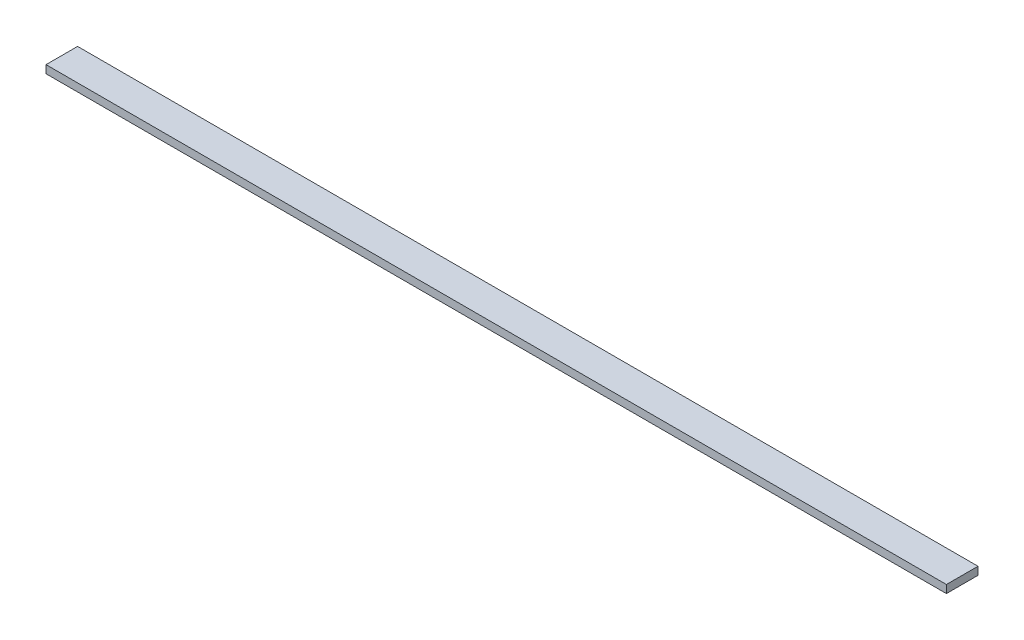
ISO-10303-21;
HEADER;
FILE_DESCRIPTION(('STEP AP214'),'2;1');
FILE_NAME('part.step','',(''),(''),'','','');
FILE_SCHEMA(('AUTOMOTIVE_DESIGN { 1 0 10303 214 1 1 1 1 }'));
ENDSEC;
DATA;
#1=APPLICATION_CONTEXT('core data for automotive mechanical design processes');
#2=APPLICATION_PROTOCOL_DEFINITION('international standard','automotive_design',2000,#1);
#3=PRODUCT_CONTEXT('',#1,'mechanical');
#4=PRODUCT('Part','Part','',(#3));
#5=PRODUCT_RELATED_PRODUCT_CATEGORY('part','',(#4));
#6=PRODUCT_DEFINITION_FORMATION('','',#4);
#7=PRODUCT_DEFINITION_CONTEXT('part definition',#1,'design');
#8=PRODUCT_DEFINITION('design','',#6,#7);
#9=PRODUCT_DEFINITION_SHAPE('','',#8);
#10=(LENGTH_UNIT() NAMED_UNIT(*) SI_UNIT(.MILLI.,.METRE.));
#11=(NAMED_UNIT(*) PLANE_ANGLE_UNIT() SI_UNIT($,.RADIAN.));
#12=(NAMED_UNIT(*) SI_UNIT($,.STERADIAN.) SOLID_ANGLE_UNIT());
#13=UNCERTAINTY_MEASURE_WITH_UNIT(LENGTH_MEASURE(1.E-05),#10,'distance_accuracy_value','');
#14=(GEOMETRIC_REPRESENTATION_CONTEXT(3) GLOBAL_UNCERTAINTY_ASSIGNED_CONTEXT((#13)) GLOBAL_UNIT_ASSIGNED_CONTEXT((#10,
#11,#12)) REPRESENTATION_CONTEXT('',''));
#15=CARTESIAN_POINT('',(0.,0.,0.));
#16=DIRECTION('',(0.,0.,1.));
#17=DIRECTION('',(1.,0.,0.));
#18=AXIS2_PLACEMENT_3D('',#15,#16,#17);
#19=CARTESIAN_POINT('',(361.949999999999,6.35,12.7));
#20=DIRECTION('',(-1.,0.,0.));
#21=DIRECTION('',(0.,0.,1.));
#22=AXIS2_PLACEMENT_3D('',#19,#20,#21);
#23=PLANE('',#22);
#24=DIRECTION('',(0.,0.,-1.));
#25=VECTOR('',#24,1.);
#26=CARTESIAN_POINT('',(361.949999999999,0.,12.7));
#27=LINE('',#26,#25);
#28=CARTESIAN_POINT('',(361.949999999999,0.,12.7));
#29=VERTEX_POINT('',#28);
#30=CARTESIAN_POINT('',(361.949999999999,0.,-12.7));
#31=VERTEX_POINT('',#30);
#32=EDGE_CURVE('E98',#29,#31,#27,.T.);
#33=ORIENTED_EDGE('',*,*,#32,.T.);
#34=DIRECTION('',(0.,-1.,0.));
#35=VECTOR('',#34,1.);
#36=CARTESIAN_POINT('',(361.949999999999,6.35,-12.7));
#37=LINE('',#36,#35);
#38=CARTESIAN_POINT('',(361.949999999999,6.35,-12.7));
#39=VERTEX_POINT('',#38);
#40=EDGE_CURVE('E11',#39,#31,#37,.T.);
#41=ORIENTED_EDGE('',*,*,#40,.F.);
#42=DIRECTION('',(0.,0.,-1.));
#43=VECTOR('',#42,1.);
#44=CARTESIAN_POINT('',(361.949999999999,6.35,12.7));
#45=LINE('',#44,#43);
#46=CARTESIAN_POINT('',(361.949999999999,6.35,12.7));
#47=VERTEX_POINT('',#46);
#48=EDGE_CURVE('E86',#47,#39,#45,.T.);
#49=ORIENTED_EDGE('',*,*,#48,.F.);
#50=DIRECTION('',(0.,-1.,0.));
#51=VECTOR('',#50,1.);
#52=CARTESIAN_POINT('',(361.949999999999,6.35,12.7));
#53=LINE('',#52,#51);
#54=EDGE_CURVE('E94',#47,#29,#53,.T.);
#55=ORIENTED_EDGE('',*,*,#54,.T.);
#56=EDGE_LOOP('',(#33,#41,#49,#55));
#57=FACE_BOUND('',#56,.T.);
#58=ADVANCED_FACE('F35',(#57),#23,.F.);
#59=CARTESIAN_POINT('',(-361.950000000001,6.35,-12.7));
#60=DIRECTION('',(0.,0.,1.));
#61=DIRECTION('',(1.,0.,0.));
#62=AXIS2_PLACEMENT_3D('',#59,#60,#61);
#63=PLANE('',#62);
#64=DIRECTION('',(-1.,0.,0.));
#65=VECTOR('',#64,1.);
#66=CARTESIAN_POINT('',(-361.950000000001,0.,-12.7));
#67=LINE('',#66,#65);
#68=CARTESIAN_POINT('',(-361.950000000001,0.,-12.7));
#69=VERTEX_POINT('',#68);
#70=EDGE_CURVE('E90',#31,#69,#67,.T.);
#71=ORIENTED_EDGE('',*,*,#70,.T.);
#72=DIRECTION('',(0.,-1.,0.));
#73=VECTOR('',#72,1.);
#74=CARTESIAN_POINT('',(-361.950000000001,6.35,-12.7));
#75=LINE('',#74,#73);
#76=CARTESIAN_POINT('',(-361.950000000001,6.35,-12.7));
#77=VERTEX_POINT('',#76);
#78=EDGE_CURVE('E43',#77,#69,#75,.T.);
#79=ORIENTED_EDGE('',*,*,#78,.F.);
#80=DIRECTION('',(-1.,0.,0.));
#81=VECTOR('',#80,1.);
#82=CARTESIAN_POINT('',(-361.950000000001,6.35,-12.7));
#83=LINE('',#82,#81);
#84=EDGE_CURVE('E81',#39,#77,#83,.T.);
#85=ORIENTED_EDGE('',*,*,#84,.F.);
#86=ORIENTED_EDGE('',*,*,#40,.T.);
#87=EDGE_LOOP('',(#71,#79,#85,#86));
#88=FACE_BOUND('',#87,.T.);
#89=ADVANCED_FACE('F89',(#88),#63,.F.);
#90=CARTESIAN_POINT('',(-361.950000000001,6.35,12.7));
#91=DIRECTION('',(1.,0.,0.));
#92=DIRECTION('',(0.,0.,-1.));
#93=AXIS2_PLACEMENT_3D('',#90,#91,#92);
#94=PLANE('',#93);
#95=DIRECTION('',(0.,0.,1.));
#96=VECTOR('',#95,1.);
#97=CARTESIAN_POINT('',(-361.950000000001,0.,12.7));
#98=LINE('',#97,#96);
#99=CARTESIAN_POINT('',(-361.950000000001,0.,12.7));
#100=VERTEX_POINT('',#99);
#101=EDGE_CURVE('E68',#69,#100,#98,.T.);
#102=ORIENTED_EDGE('',*,*,#101,.T.);
#103=DIRECTION('',(0.,-1.,0.));
#104=VECTOR('',#103,1.);
#105=CARTESIAN_POINT('',(-361.950000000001,6.35,12.7));
#106=LINE('',#105,#104);
#107=CARTESIAN_POINT('',(-361.950000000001,6.35,12.7));
#108=VERTEX_POINT('',#107);
#109=EDGE_CURVE('E91',#108,#100,#106,.T.);
#110=ORIENTED_EDGE('',*,*,#109,.F.);
#111=DIRECTION('',(0.,0.,1.));
#112=VECTOR('',#111,1.);
#113=CARTESIAN_POINT('',(-361.950000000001,6.35,12.7));
#114=LINE('',#113,#112);
#115=EDGE_CURVE('E84',#77,#108,#114,.T.);
#116=ORIENTED_EDGE('',*,*,#115,.F.);
#117=ORIENTED_EDGE('',*,*,#78,.T.);
#118=EDGE_LOOP('',(#102,#110,#116,#117));
#119=FACE_BOUND('',#118,.T.);
#120=ADVANCED_FACE('F92',(#119),#94,.F.);
#121=CARTESIAN_POINT('',(-361.950000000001,6.35,12.7));
#122=DIRECTION('',(0.,0.,-1.));
#123=DIRECTION('',(-1.,0.,0.));
#124=AXIS2_PLACEMENT_3D('',#121,#122,#123);
#125=PLANE('',#124);
#126=DIRECTION('',(1.,0.,0.));
#127=VECTOR('',#126,1.);
#128=CARTESIAN_POINT('',(-361.950000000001,0.,12.7));
#129=LINE('',#128,#127);
#130=EDGE_CURVE('E74',#100,#29,#129,.T.);
#131=ORIENTED_EDGE('',*,*,#130,.T.);
#132=ORIENTED_EDGE('',*,*,#54,.F.);
#133=DIRECTION('',(1.,0.,0.));
#134=VECTOR('',#133,1.);
#135=CARTESIAN_POINT('',(-361.950000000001,6.35,12.7));
#136=LINE('',#135,#134);
#137=EDGE_CURVE('E51',#108,#47,#136,.T.);
#138=ORIENTED_EDGE('',*,*,#137,.F.);
#139=ORIENTED_EDGE('',*,*,#109,.T.);
#140=EDGE_LOOP('',(#131,#132,#138,#139));
#141=FACE_BOUND('',#140,.T.);
#142=ADVANCED_FACE('F105',(#141),#125,.F.);
#143=CARTESIAN_POINT('',(0.,6.35,0.));
#144=DIRECTION('',(0.,-1.,0.));
#145=DIRECTION('',(0.,0.,-1.));
#146=AXIS2_PLACEMENT_3D('',#143,#144,#145);
#147=PLANE('',#146);
#148=ORIENTED_EDGE('',*,*,#48,.T.);
#149=ORIENTED_EDGE('',*,*,#84,.T.);
#150=ORIENTED_EDGE('',*,*,#115,.T.);
#151=ORIENTED_EDGE('',*,*,#137,.T.);
#152=EDGE_LOOP('',(#148,#149,#150,#151));
#153=FACE_BOUND('',#152,.T.);
#154=ADVANCED_FACE('F82',(#153),#147,.F.);
#155=CARTESIAN_POINT('',(0.,0.,0.));
#156=DIRECTION('',(0.,-1.,0.));
#157=DIRECTION('',(0.,0.,-1.));
#158=AXIS2_PLACEMENT_3D('',#155,#156,#157);
#159=PLANE('',#158);
#160=ORIENTED_EDGE('',*,*,#32,.F.);
#161=ORIENTED_EDGE('',*,*,#130,.F.);
#162=ORIENTED_EDGE('',*,*,#101,.F.);
#163=ORIENTED_EDGE('',*,*,#70,.F.);
#164=EDGE_LOOP('',(#160,#161,#162,#163));
#165=FACE_BOUND('',#164,.T.);
#166=ADVANCED_FACE('F108',(#165),#159,.T.);
#167=CLOSED_SHELL('',(#58,#89,#120,#142,#154,#166));
#168=MANIFOLD_SOLID_BREP('B2',#167);
#169=ADVANCED_BREP_SHAPE_REPRESENTATION('',(#18,#168),#14);
#170=SHAPE_DEFINITION_REPRESENTATION(#9,#169);
ENDSEC;
END-ISO-10303-21;
